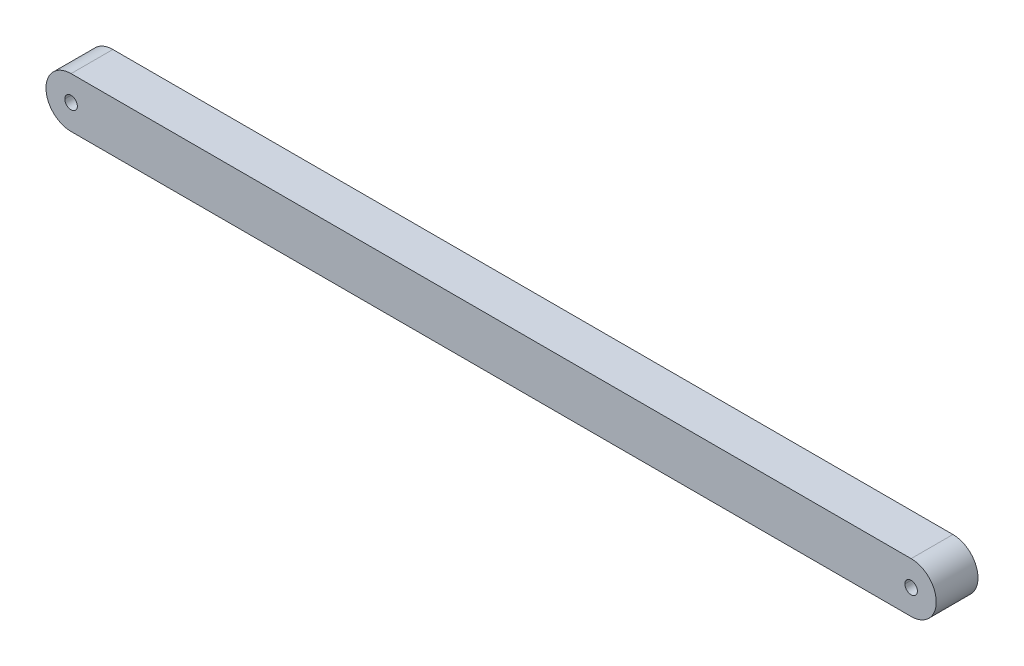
ISO-10303-21;
HEADER;
FILE_DESCRIPTION(('STEP AP214'),'2;1');
FILE_NAME('part.step','',(''),(''),'','','');
FILE_SCHEMA(('AUTOMOTIVE_DESIGN { 1 0 10303 214 1 1 1 1 }'));
ENDSEC;
DATA;
#1=APPLICATION_CONTEXT('core data for automotive mechanical design processes');
#2=APPLICATION_PROTOCOL_DEFINITION('international standard','automotive_design',2000,#1);
#3=PRODUCT_CONTEXT('',#1,'mechanical');
#4=PRODUCT('Part','Part','',(#3));
#5=PRODUCT_RELATED_PRODUCT_CATEGORY('part','',(#4));
#6=PRODUCT_DEFINITION_FORMATION('','',#4);
#7=PRODUCT_DEFINITION_CONTEXT('part definition',#1,'design');
#8=PRODUCT_DEFINITION('design','',#6,#7);
#9=PRODUCT_DEFINITION_SHAPE('','',#8);
#10=(LENGTH_UNIT() NAMED_UNIT(*) SI_UNIT(.MILLI.,.METRE.));
#11=(NAMED_UNIT(*) PLANE_ANGLE_UNIT() SI_UNIT($,.RADIAN.));
#12=(NAMED_UNIT(*) SI_UNIT($,.STERADIAN.) SOLID_ANGLE_UNIT());
#13=UNCERTAINTY_MEASURE_WITH_UNIT(LENGTH_MEASURE(1.E-05),#10,'distance_accuracy_value','');
#14=(GEOMETRIC_REPRESENTATION_CONTEXT(3) GLOBAL_UNCERTAINTY_ASSIGNED_CONTEXT((#13)) GLOBAL_UNIT_ASSIGNED_CONTEXT((#10,
#11,#12)) REPRESENTATION_CONTEXT('',''));
#15=CARTESIAN_POINT('',(0.,0.,0.));
#16=DIRECTION('',(0.,0.,1.));
#17=DIRECTION('',(1.,0.,0.));
#18=AXIS2_PLACEMENT_3D('',#15,#16,#17);
#19=CARTESIAN_POINT('',(-23.5495364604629,1.46409480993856,10.));
#20=DIRECTION('',(0.,0.,1.));
#21=DIRECTION('',(1.,0.,0.));
#22=AXIS2_PLACEMENT_3D('',#19,#20,#21);
#23=PLANE('',#22);
#24=CARTESIAN_POINT('',(183.779742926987,1.46411417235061,10.));
#25=CARTESIAN_POINT('',(183.881768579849,1.46415562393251,10.));
#26=CARTESIAN_POINT('',(183.98306451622,1.46677630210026,10.));
#27=CARTESIAN_POINT('',(184.258275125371,1.48079227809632,10.));
#28=CARTESIAN_POINT('',(184.391322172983,1.49405022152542,10.));
#29=CARTESIAN_POINT('',(184.76433292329,1.54044123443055,10.));
#30=CARTESIAN_POINT('',(184.956684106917,1.57766142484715,10.));
#31=CARTESIAN_POINT('',(185.471697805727,1.69763730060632,10.));
#32=CARTESIAN_POINT('',(185.747222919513,1.78885193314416,10.));
#33=CARTESIAN_POINT('',(186.359652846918,2.03382613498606,10.));
#34=CARTESIAN_POINT('',(186.679528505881,2.19947093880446,10.));
#35=CARTESIAN_POINT('',(187.42967806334,2.67234281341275,10.));
#36=CARTESIAN_POINT('',(187.831599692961,3.00893660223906,10.));
#37=CARTESIAN_POINT('',(189.58311425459,4.90156993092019,10.));
#38=CARTESIAN_POINT('',(190.109022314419,7.02572087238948,10.));
#39=CARTESIAN_POINT('',(189.347604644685,9.86745907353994,10.));
#40=CARTESIAN_POINT('',(188.935251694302,10.6570080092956,10.));
#41=CARTESIAN_POINT('',(187.998553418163,11.7685418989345,10.));
#42=CARTESIAN_POINT('',(187.564558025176,12.1580203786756,10.));
#43=CARTESIAN_POINT('',(186.749297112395,12.6911990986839,10.));
#44=CARTESIAN_POINT('',(186.411300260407,12.8716502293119,10.));
#45=CARTESIAN_POINT('',(185.803841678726,13.1178933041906,10.));
#46=CARTESIAN_POINT('',(185.563533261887,13.1993327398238,10.));
#47=CARTESIAN_POINT('',(185.13972120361,13.3102722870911,10.));
#48=CARTESIAN_POINT('',(184.974738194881,13.3466238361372,10.));
#49=CARTESIAN_POINT('',(184.687203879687,13.3960515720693,10.));
#50=CARTESIAN_POINT('',(184.575367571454,13.4122020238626,10.));
#51=CARTESIAN_POINT('',(184.339985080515,13.4389766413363,10.));
#52=CARTESIAN_POINT('',(184.217984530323,13.4499164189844,10.));
#53=CARTESIAN_POINT('',(183.97063689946,13.4617723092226,10.));
#54=CARTESIAN_POINT('',(183.875192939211,13.4640753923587,10.));
#55=CARTESIAN_POINT('',(183.779742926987,13.4641141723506,10.));
#56=B_SPLINE_CURVE_WITH_KNOTS('',3,(#24,#25,#26,#27,#28,#29,#30,#31,#32,#33,#34,#35,#36,#37,#38,
#39,#40,#41,#42,#43,#44,#45,#46,#47,#48,#49,#50,#51,#52,#53,#54,#55),.UNSPECIFIED.,.F.,.F.,(4,2,
2,2,2,2,2,2,2,2,2,2,2,2,2,4),(0.,0.00755193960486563,0.0205950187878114,0.04518956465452,
0.0890108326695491,0.148030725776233,0.237028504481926,0.591189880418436,0.742395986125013,
0.84087733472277,0.902499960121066,0.940047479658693,0.962855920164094,0.97693375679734,
0.991107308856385,1.),.UNSPECIFIED.);
#57=CARTESIAN_POINT('',(183.779742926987,1.46411417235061,10.));
#58=VERTEX_POINT('',#57);
#59=CARTESIAN_POINT('',(183.779742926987,13.4641141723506,10.));
#60=VERTEX_POINT('',#59);
#61=EDGE_CURVE('E11',#58,#60,#56,.T.);
#62=ORIENTED_EDGE('',*,*,#61,.T.);
#63=CARTESIAN_POINT('',(183.779742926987,13.4641141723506,10.));
#64=DIRECTION('',(-0.999999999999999,-5.14783049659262E-08,0.));
#65=VECTOR('',#64,1.);
#66=LINE('',#63,#65);
#67=CARTESIAN_POINT('',(-17.2202570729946,13.4641038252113,10.));
#68=VERTEX_POINT('',#67);
#69=EDGE_CURVE('E25',#60,#68,#66,.T.);
#70=ORIENTED_EDGE('',*,*,#69,.T.);
#71=CARTESIAN_POINT('',(-17.2202570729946,13.4641038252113,10.));
#72=CARTESIAN_POINT('',(-17.3222844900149,13.464103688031,10.));
#73=CARTESIAN_POINT('',(-17.4235795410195,13.461482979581,10.));
#74=CARTESIAN_POINT('',(-17.6987892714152,13.4474669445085,10.));
#75=CARTESIAN_POINT('',(-17.8318363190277,13.434208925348,10.));
#76=CARTESIAN_POINT('',(-18.2048470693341,13.387817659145,10.));
#77=CARTESIAN_POINT('',(-18.3971982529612,13.35059727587,10.));
#78=CARTESIAN_POINT('',(-18.912211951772,13.2306207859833,10.));
#79=CARTESIAN_POINT('',(-19.1877370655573,13.1394056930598,10.));
#80=CARTESIAN_POINT('',(-19.8001669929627,12.8944302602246,10.));
#81=CARTESIAN_POINT('',(-20.1200426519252,12.7287846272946,10.));
#82=CARTESIAN_POINT('',(-20.8701922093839,12.2559103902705,10.));
#83=CARTESIAN_POINT('',(-21.2721138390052,11.9193149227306,10.));
#84=CARTESIAN_POINT('',(-23.0236284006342,10.0266721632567,10.));
#85=CARTESIAN_POINT('',(-23.5495364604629,7.90251065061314,10.));
#86=CARTESIAN_POINT('',(-22.7881187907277,5.06075830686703,10.));
#87=CARTESIAN_POINT('',(-22.3757658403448,4.27120544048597,10.));
#88=CARTESIAN_POINT('',(-21.4390675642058,3.15966601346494,10.));
#89=CARTESIAN_POINT('',(-21.0050721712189,2.77018559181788,10.));
#90=CARTESIAN_POINT('',(-20.1898112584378,2.23700420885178,10.));
#91=CARTESIAN_POINT('',(-19.8518144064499,2.05655217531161,10.));
#92=CARTESIAN_POINT('',(-19.244355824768,1.81030786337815,10.));
#93=CARTESIAN_POINT('',(-19.00404740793,1.72886801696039,10.));
#94=CARTESIAN_POINT('',(-18.5802353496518,1.61792790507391,10.));
#95=CARTESIAN_POINT('',(-18.4152523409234,1.58157616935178,10.));
#96=CARTESIAN_POINT('',(-18.1277180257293,1.53214817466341,10.));
#97=CARTESIAN_POINT('',(-18.0158817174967,1.51599763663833,10.));
#98=CARTESIAN_POINT('',(-17.7804992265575,1.48922287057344,10.));
#99=CARTESIAN_POINT('',(-17.6584986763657,1.47828302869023,10.));
#100=CARTESIAN_POINT('',(-17.4111518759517,1.46642708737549,10.));
#101=CARTESIAN_POINT('',(-17.3157087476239,1.46412397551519,10.));
#102=CARTESIAN_POINT('',(-17.2202570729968,1.4641238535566,10.));
#103=B_SPLINE_CURVE_WITH_KNOTS('',3,(#71,#72,#73,#74,#75,#76,#77,#78,#79,#80,#81,#82,#83,#84,
#85,#86,#87,#88,#89,#90,#91,#92,#93,#94,#95,#96,#97,#98,#99,#100,#101,#102),.UNSPECIFIED.,.F.,
.F.,(4,2,2,2,2,2,2,2,2,2,2,2,2,2,2,4),(0.,0.0075518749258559,0.0205949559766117,
0.0451895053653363,0.0890107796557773,0.148030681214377,0.237028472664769,0.591189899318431,
0.742396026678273,0.840877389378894,0.90250002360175,0.940047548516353,0.96285599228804,
0.976933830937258,0.991107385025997,1.),.UNSPECIFIED.);
#104=CARTESIAN_POINT('',(-17.2202570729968,1.4641238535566,10.));
#105=VERTEX_POINT('',#104);
#106=EDGE_CURVE('E228',#68,#105,#103,.T.);
#107=ORIENTED_EDGE('',*,*,#106,.T.);
#108=CARTESIAN_POINT('',(-17.2202570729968,1.4641238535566,10.));
#109=DIRECTION('',(0.999999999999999,-4.81652039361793E-08,0.));
#110=VECTOR('',#109,1.);
#111=LINE('',#108,#110);
#112=EDGE_CURVE('E170',#105,#58,#111,.T.);
#113=ORIENTED_EDGE('',*,*,#112,.T.);
#114=EDGE_LOOP('',(#62,#70,#107,#113));
#115=FACE_BOUND('',#114,.T.);
#116=CARTESIAN_POINT('',(183.779742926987,7.46411417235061,10.));
#117=DIRECTION('',(0.,0.,1.));
#118=DIRECTION('',(-1.,0.,0.));
#119=AXIS2_PLACEMENT_3D('',#116,#117,#118);
#120=CIRCLE('',#119,1.5);
#121=CARTESIAN_POINT('',(182.279742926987,7.46411417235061,10.));
#122=VERTEX_POINT('',#121);
#123=CARTESIAN_POINT('',(185.279742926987,7.4641141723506,10.));
#124=VERTEX_POINT('',#123);
#125=EDGE_CURVE('E96',#122,#124,#120,.T.);
#126=ORIENTED_EDGE('',*,*,#125,.F.);
#127=CARTESIAN_POINT('',(183.779742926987,7.46411417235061,10.));
#128=DIRECTION('',(0.,0.,1.));
#129=DIRECTION('',(1.,0.,0.));
#130=AXIS2_PLACEMENT_3D('',#127,#128,#129);
#131=CIRCLE('',#130,1.5);
#132=EDGE_CURVE('E350',#124,#122,#131,.T.);
#133=ORIENTED_EDGE('',*,*,#132,.F.);
#134=EDGE_LOOP('',(#126,#133));
#135=FACE_BOUND('',#134,.T.);
#136=CARTESIAN_POINT('',(-17.2202570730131,7.46411417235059,10.));
#137=DIRECTION('',(0.,0.,1.));
#138=DIRECTION('',(-1.,0.,0.));
#139=AXIS2_PLACEMENT_3D('',#136,#137,#138);
#140=CIRCLE('',#139,1.5);
#141=CARTESIAN_POINT('',(-18.7202570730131,7.46411417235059,10.));
#142=VERTEX_POINT('',#141);
#143=CARTESIAN_POINT('',(-15.720257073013,7.46411417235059,10.));
#144=VERTEX_POINT('',#143);
#145=EDGE_CURVE('E340',#142,#144,#140,.T.);
#146=ORIENTED_EDGE('',*,*,#145,.F.);
#147=CARTESIAN_POINT('',(-17.2202570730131,7.46411417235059,10.));
#148=DIRECTION('',(0.,0.,1.));
#149=DIRECTION('',(1.,0.,0.));
#150=AXIS2_PLACEMENT_3D('',#147,#148,#149);
#151=CIRCLE('',#150,1.5);
#152=EDGE_CURVE('E343',#144,#142,#151,.T.);
#153=ORIENTED_EDGE('',*,*,#152,.F.);
#154=EDGE_LOOP('',(#146,#153));
#155=FACE_BOUND('',#154,.T.);
#156=ADVANCED_FACE('F17',(#115,#135,#155),#23,.T.);
#157=CARTESIAN_POINT('',(-17.2202570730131,7.46411417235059,10.));
#158=DIRECTION('',(0.,0.,-1.));
#159=DIRECTION('',(0.,-1.,0.));
#160=AXIS2_PLACEMENT_3D('',#157,#158,#159);
#161=CYLINDRICAL_SURFACE('',#160,1.5);
#162=ORIENTED_EDGE('',*,*,#152,.T.);
#163=CARTESIAN_POINT('',(-18.7202570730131,7.4641141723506,10.));
#164=DIRECTION('',(0.,0.,-1.));
#165=VECTOR('',#164,1.);
#166=LINE('',#163,#165);
#167=CARTESIAN_POINT('',(-18.7202570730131,7.46411417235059,0.));
#168=VERTEX_POINT('',#167);
#169=EDGE_CURVE('E354',#142,#168,#166,.T.);
#170=ORIENTED_EDGE('',*,*,#169,.T.);
#171=CARTESIAN_POINT('',(-15.720257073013,7.4641141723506,0.));
#172=CARTESIAN_POINT('',(-15.7203680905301,7.7373639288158,0.));
#173=CARTESIAN_POINT('',(-15.794706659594,8.00502312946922,0.));
#174=CARTESIAN_POINT('',(-16.0147094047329,8.36956636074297,0.));
#175=CARTESIAN_POINT('',(-16.1129760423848,8.48736806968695,0.));
#176=CARTESIAN_POINT('',(-16.3019844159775,8.65432883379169,0.));
#177=CARTESIAN_POINT('',(-16.3830890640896,8.71272632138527,0.));
#178=CARTESIAN_POINT('',(-16.5300813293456,8.79776078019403,0.));
#179=CARTESIAN_POINT('',(-16.5931752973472,8.82857841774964,0.));
#180=CARTESIAN_POINT('',(-16.7310650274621,8.88432397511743,0.));
#181=CARTESIAN_POINT('',(-16.8078215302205,8.91010531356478,0.));
#182=CARTESIAN_POINT('',(-16.9397356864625,8.93800261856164,0.));
#183=CARTESIAN_POINT('',(-16.9701335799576,8.94347907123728,0.));
#184=CARTESIAN_POINT('',(-17.0330603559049,8.9527534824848,0.));
#185=CARTESIAN_POINT('',(-17.065922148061,8.9566933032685,0.));
#186=CARTESIAN_POINT('',(-17.1286082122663,8.96149888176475,0.));
#187=CARTESIAN_POINT('',(-17.1524629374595,8.96281756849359,0.));
#188=CARTESIAN_POINT('',(-17.2010432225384,8.9641550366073,0.));
#189=CARTESIAN_POINT('',(-17.2232292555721,8.9642747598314,0.));
#190=CARTESIAN_POINT('',(-17.2819345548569,8.96329305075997,0.));
#191=CARTESIAN_POINT('',(-17.311992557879,8.96159697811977,0.));
#192=CARTESIAN_POINT('',(-17.4121727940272,8.95351516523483,0.));
#193=CARTESIAN_POINT('',(-17.4586862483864,8.94582381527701,0.));
#194=CARTESIAN_POINT('',(-17.5971943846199,8.91905877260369,0.));
#195=CARTESIAN_POINT('',(-17.6674898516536,8.89771046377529,0.));
#196=CARTESIAN_POINT('',(-17.8535556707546,8.82979666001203,0.));
#197=CARTESIAN_POINT('',(-17.9512560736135,8.77828893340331,0.));
#198=CARTESIAN_POINT('',(-18.1850076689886,8.62552157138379,0.));
#199=CARTESIAN_POINT('',(-18.3044006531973,8.51296978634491,0.));
#200=CARTESIAN_POINT('',(-18.6087096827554,8.1230520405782,0.));
#201=CARTESIAN_POINT('',(-18.7201211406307,7.79868741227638,0.));
#202=CARTESIAN_POINT('',(-18.720257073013,7.46411417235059,0.));
#203=B_SPLINE_CURVE_WITH_KNOTS('',3,(#171,#172,#173,#174,#175,#176,#177,#178,#179,#180,#181,
#182,#183,#184,#185,#186,#187,#188,#189,#190,#191,#192,#193,#194,#195,#196,#197,#198,#199,#200,
#201,#202),.UNSPECIFIED.,.F.,.F.,(4,2,2,2,2,2,2,2,2,2,2,2,2,2,2,4),(0.,0.144163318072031,
0.224609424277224,0.277196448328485,0.314194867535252,0.355660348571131,0.36785753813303,
0.380267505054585,0.387564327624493,0.393689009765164,0.403779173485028,0.428436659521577,
0.477485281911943,0.56469175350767,0.705509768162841,1.),.UNSPECIFIED.);
#204=CARTESIAN_POINT('',(-15.7202570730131,7.46411417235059,0.));
#205=VERTEX_POINT('',#204);
#206=EDGE_CURVE('E366',#205,#168,#203,.T.);
#207=ORIENTED_EDGE('',*,*,#206,.F.);
#208=CARTESIAN_POINT('',(-15.7202570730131,7.46411417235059,0.));
#209=DIRECTION('',(0.,0.,1.));
#210=VECTOR('',#209,1.);
#211=LINE('',#208,#210);
#212=EDGE_CURVE('E357',#205,#144,#211,.T.);
#213=ORIENTED_EDGE('',*,*,#212,.T.);
#214=EDGE_LOOP('',(#162,#170,#207,#213));
#215=FACE_BOUND('',#214,.T.);
#216=ADVANCED_FACE('F330',(#215),#161,.F.);
#217=CARTESIAN_POINT('',(-17.2202570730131,7.46411417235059,10.));
#218=DIRECTION('',(0.,0.,-1.));
#219=DIRECTION('',(0.,1.,0.));
#220=AXIS2_PLACEMENT_3D('',#217,#218,#219);
#221=CYLINDRICAL_SURFACE('',#220,1.5);
#222=CARTESIAN_POINT('',(-18.720257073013,7.46411417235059,0.));
#223=CARTESIAN_POINT('',(-18.720146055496,7.1908644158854,0.));
#224=CARTESIAN_POINT('',(-18.6458074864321,6.92320521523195,0.));
#225=CARTESIAN_POINT('',(-18.4258047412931,6.55866198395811,0.));
#226=CARTESIAN_POINT('',(-18.3275381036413,6.44086027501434,0.));
#227=CARTESIAN_POINT('',(-18.1385297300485,6.27389951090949,0.));
#228=CARTESIAN_POINT('',(-18.0574250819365,6.21550202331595,0.));
#229=CARTESIAN_POINT('',(-17.9104328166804,6.13046756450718,0.));
#230=CARTESIAN_POINT('',(-17.8473388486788,6.09964992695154,0.));
#231=CARTESIAN_POINT('',(-17.709449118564,6.04390436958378,0.));
#232=CARTESIAN_POINT('',(-17.6326926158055,6.0181230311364,0.));
#233=CARTESIAN_POINT('',(-17.5007784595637,5.99022572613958,0.));
#234=CARTESIAN_POINT('',(-17.4703805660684,5.98474927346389,0.));
#235=CARTESIAN_POINT('',(-17.4074537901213,5.9754748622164,0.));
#236=CARTESIAN_POINT('',(-17.374591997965,5.97153504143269,0.));
#237=CARTESIAN_POINT('',(-17.3119059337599,5.96672946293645,0.));
#238=CARTESIAN_POINT('',(-17.2880512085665,5.9654107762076,0.));
#239=CARTESIAN_POINT('',(-17.2394709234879,5.9640733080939,0.));
#240=CARTESIAN_POINT('',(-17.2172848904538,5.96395358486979,0.));
#241=CARTESIAN_POINT('',(-17.1585795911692,5.96493529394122,0.));
#242=CARTESIAN_POINT('',(-17.128521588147,5.96663136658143,0.));
#243=CARTESIAN_POINT('',(-17.028341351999,5.97471317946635,0.));
#244=CARTESIAN_POINT('',(-16.9818278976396,5.98240452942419,0.));
#245=CARTESIAN_POINT('',(-16.8433197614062,6.0091695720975,0.));
#246=CARTESIAN_POINT('',(-16.7730242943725,6.03051788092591,0.));
#247=CARTESIAN_POINT('',(-16.5869584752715,6.09843168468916,0.));
#248=CARTESIAN_POINT('',(-16.4892580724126,6.14993941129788,0.));
#249=CARTESIAN_POINT('',(-16.2555064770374,6.3027067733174,0.));
#250=CARTESIAN_POINT('',(-16.1361134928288,6.41525855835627,0.));
#251=CARTESIAN_POINT('',(-15.8318044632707,6.80517630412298,0.));
#252=CARTESIAN_POINT('',(-15.7203930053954,7.12954093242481,0.));
#253=CARTESIAN_POINT('',(-15.720257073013,7.4641141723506,0.));
#254=B_SPLINE_CURVE_WITH_KNOTS('',3,(#222,#223,#224,#225,#226,#227,#228,#229,#230,#231,#232,
#233,#234,#235,#236,#237,#238,#239,#240,#241,#242,#243,#244,#245,#246,#247,#248,#249,#250,#251,
#252,#253),.UNSPECIFIED.,.F.,.F.,(4,2,2,2,2,2,2,2,2,2,2,2,2,2,2,4),(0.,0.144163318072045,
0.224609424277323,0.277196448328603,0.314194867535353,0.355660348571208,0.367857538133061,
0.380267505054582,0.387564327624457,0.393689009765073,0.403779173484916,0.428436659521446,
0.477485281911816,0.564691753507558,0.705509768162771,1.),.UNSPECIFIED.);
#255=EDGE_CURVE('E363',#168,#205,#254,.T.);
#256=ORIENTED_EDGE('',*,*,#255,.F.);
#257=ORIENTED_EDGE('',*,*,#169,.F.);
#258=ORIENTED_EDGE('',*,*,#145,.T.);
#259=ORIENTED_EDGE('',*,*,#212,.F.);
#260=EDGE_LOOP('',(#256,#257,#258,#259));
#261=FACE_BOUND('',#260,.T.);
#262=ADVANCED_FACE('F334',(#261),#221,.F.);
#263=CARTESIAN_POINT('',(-23.5495364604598,1.46409347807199,0.));
#264=DIRECTION('',(0.,0.,-1.));
#265=DIRECTION('',(0.,1.,0.));
#266=AXIS2_PLACEMENT_3D('',#263,#264,#265);
#267=PLANE('',#266);
#268=CARTESIAN_POINT('',(-17.2202570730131,7.46411417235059,0.));
#269=DIRECTION('',(0.,0.,1.));
#270=DIRECTION('',(3.83489536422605E-12,1.,0.));
#271=AXIS2_PLACEMENT_3D('',#268,#269,#270);
#272=CIRCLE('',#271,6.00000000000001);
#273=CARTESIAN_POINT('',(-17.2202570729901,13.4641044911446,0.));
#274=VERTEX_POINT('',#273);
#275=CARTESIAN_POINT('',(-17.2202570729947,1.46412451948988,0.));
#276=VERTEX_POINT('',#275);
#277=EDGE_CURVE('E194',#274,#276,#272,.T.);
#278=ORIENTED_EDGE('',*,*,#277,.F.);
#279=CARTESIAN_POINT('',(183.779742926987,13.4641141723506,0.));
#280=DIRECTION('',(-1.,0.,0.));
#281=VECTOR('',#280,1.);
#282=LINE('',#279,#281);
#283=CARTESIAN_POINT('',(183.779742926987,13.4641141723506,0.));
#284=VERTEX_POINT('',#283);
#285=EDGE_CURVE('E245',#284,#274,#282,.T.);
#286=ORIENTED_EDGE('',*,*,#285,.F.);
#287=CARTESIAN_POINT('',(183.779742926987,7.46411417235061,0.));
#288=DIRECTION('',(0.,0.,1.));
#289=DIRECTION('',(0.,-1.,0.));
#290=AXIS2_PLACEMENT_3D('',#287,#288,#289);
#291=CIRCLE('',#290,6.);
#292=CARTESIAN_POINT('',(183.779742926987,1.46411417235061,0.));
#293=VERTEX_POINT('',#292);
#294=EDGE_CURVE('E284',#293,#284,#291,.T.);
#295=ORIENTED_EDGE('',*,*,#294,.F.);
#296=CARTESIAN_POINT('',(-17.220257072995,1.46411417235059,0.));
#297=DIRECTION('',(1.,0.,0.));
#298=VECTOR('',#297,1.);
#299=LINE('',#296,#298);
#300=EDGE_CURVE('E107',#276,#293,#299,.T.);
#301=ORIENTED_EDGE('',*,*,#300,.F.);
#302=EDGE_LOOP('',(#278,#286,#295,#301));
#303=FACE_BOUND('',#302,.T.);
#304=ORIENTED_EDGE('',*,*,#206,.T.);
#305=ORIENTED_EDGE('',*,*,#255,.T.);
#306=EDGE_LOOP('',(#304,#305));
#307=FACE_BOUND('',#306,.T.);
#308=CARTESIAN_POINT('',(185.279742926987,7.46411417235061,0.));
#309=CARTESIAN_POINT('',(185.27963190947,7.73736392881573,0.));
#310=CARTESIAN_POINT('',(185.205293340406,8.00502312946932,0.));
#311=CARTESIAN_POINT('',(184.985290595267,8.36956636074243,0.));
#312=CARTESIAN_POINT('',(184.887023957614,8.48736806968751,0.));
#313=CARTESIAN_POINT('',(184.698015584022,8.65432883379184,0.));
#314=CARTESIAN_POINT('',(184.61691093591,8.71272632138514,0.));
#315=CARTESIAN_POINT('',(184.469918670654,8.79776078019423,0.));
#316=CARTESIAN_POINT('',(184.406824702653,8.82857841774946,0.));
#317=CARTESIAN_POINT('',(184.268934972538,8.88432397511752,0.));
#318=CARTESIAN_POINT('',(184.19217846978,8.91010531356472,0.));
#319=CARTESIAN_POINT('',(184.060264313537,8.93800261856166,0.));
#320=CARTESIAN_POINT('',(184.029866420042,8.94347907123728,0.));
#321=CARTESIAN_POINT('',(183.966939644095,8.95275348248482,0.));
#322=CARTESIAN_POINT('',(183.934077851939,8.9566933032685,0.));
#323=CARTESIAN_POINT('',(183.871391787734,8.96149888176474,0.));
#324=CARTESIAN_POINT('',(183.84753706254,8.9628175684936,0.));
#325=CARTESIAN_POINT('',(183.798956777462,8.96415503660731,0.));
#326=CARTESIAN_POINT('',(183.776770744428,8.96427475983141,0.));
#327=CARTESIAN_POINT('',(183.718065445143,8.96329305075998,0.));
#328=CARTESIAN_POINT('',(183.688007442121,8.96159697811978,0.));
#329=CARTESIAN_POINT('',(183.587827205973,8.95351516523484,0.));
#330=CARTESIAN_POINT('',(183.541313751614,8.94582381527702,0.));
#331=CARTESIAN_POINT('',(183.40280561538,8.91905877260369,0.));
#332=CARTESIAN_POINT('',(183.332510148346,8.89771046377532,0.));
#333=CARTESIAN_POINT('',(183.146444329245,8.829796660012,0.));
#334=CARTESIAN_POINT('',(183.048743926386,8.77828893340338,0.));
#335=CARTESIAN_POINT('',(182.814992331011,8.62552157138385,0.));
#336=CARTESIAN_POINT('',(182.695599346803,8.51296978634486,0.));
#337=CARTESIAN_POINT('',(182.391290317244,8.12305204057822,0.));
#338=CARTESIAN_POINT('',(182.279878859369,7.79868741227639,0.));
#339=CARTESIAN_POINT('',(182.279742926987,7.46411417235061,0.));
#340=B_SPLINE_CURVE_WITH_KNOTS('',3,(#308,#309,#310,#311,#312,#313,#314,#315,#316,#317,#318,
#319,#320,#321,#322,#323,#324,#325,#326,#327,#328,#329,#330,#331,#332,#333,#334,#335,#336,#337,
#338,#339),.UNSPECIFIED.,.F.,.F.,(4,2,2,2,2,2,2,2,2,2,2,2,2,2,2,4),(0.,0.144163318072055,
0.224609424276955,0.277196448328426,0.314194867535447,0.35566034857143,0.367857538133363,
0.380267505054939,0.387564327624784,0.393689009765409,0.403779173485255,0.42843665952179,
0.477485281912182,0.564691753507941,0.70550976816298,1.),.UNSPECIFIED.);
#341=CARTESIAN_POINT('',(185.279742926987,7.4641141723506,0.));
#342=VERTEX_POINT('',#341);
#343=CARTESIAN_POINT('',(182.279742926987,7.46411417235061,0.));
#344=VERTEX_POINT('',#343);
#345=EDGE_CURVE('E82',#342,#344,#340,.T.);
#346=ORIENTED_EDGE('',*,*,#345,.T.);
#347=CARTESIAN_POINT('',(182.279742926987,7.46411417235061,0.));
#348=CARTESIAN_POINT('',(182.279853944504,7.19086441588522,0.));
#349=CARTESIAN_POINT('',(182.354192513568,6.92320521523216,0.));
#350=CARTESIAN_POINT('',(182.574195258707,6.55866198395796,0.));
#351=CARTESIAN_POINT('',(182.672461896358,6.44086027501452,0.));
#352=CARTESIAN_POINT('',(182.861470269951,6.27389951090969,0.));
#353=CARTESIAN_POINT('',(182.942574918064,6.21550202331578,0.));
#354=CARTESIAN_POINT('',(183.089567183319,6.13046756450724,0.));
#355=CARTESIAN_POINT('',(183.152661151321,6.09964992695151,0.));
#356=CARTESIAN_POINT('',(183.290550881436,6.0439043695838,0.));
#357=CARTESIAN_POINT('',(183.367307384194,6.01812303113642,0.));
#358=CARTESIAN_POINT('',(183.499221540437,5.99022572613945,0.));
#359=CARTESIAN_POINT('',(183.529619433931,5.98474927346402,0.));
#360=CARTESIAN_POINT('',(183.592546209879,5.97547486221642,0.));
#361=CARTESIAN_POINT('',(183.625408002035,5.9715350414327,0.));
#362=CARTESIAN_POINT('',(183.68809406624,5.96672946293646,0.));
#363=CARTESIAN_POINT('',(183.711948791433,5.96541077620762,0.));
#364=CARTESIAN_POINT('',(183.760529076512,5.96407330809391,0.));
#365=CARTESIAN_POINT('',(183.782715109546,5.96395358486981,0.));
#366=CARTESIAN_POINT('',(183.841420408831,5.96493529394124,0.));
#367=CARTESIAN_POINT('',(183.871478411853,5.96663136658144,0.));
#368=CARTESIAN_POINT('',(183.971658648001,5.97471317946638,0.));
#369=CARTESIAN_POINT('',(184.01817210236,5.98240452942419,0.));
#370=CARTESIAN_POINT('',(184.156680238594,6.0091695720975,0.));
#371=CARTESIAN_POINT('',(184.226975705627,6.03051788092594,0.));
#372=CARTESIAN_POINT('',(184.413041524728,6.09843168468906,0.));
#373=CARTESIAN_POINT('',(184.510741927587,6.14993941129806,0.));
#374=CARTESIAN_POINT('',(184.744493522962,6.30270677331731,0.));
#375=CARTESIAN_POINT('',(184.863886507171,6.41525855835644,0.));
#376=CARTESIAN_POINT('',(185.168195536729,6.80517630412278,0.));
#377=CARTESIAN_POINT('',(185.279606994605,7.12954093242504,0.));
#378=CARTESIAN_POINT('',(185.279742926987,7.46411417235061,0.));
#379=B_SPLINE_CURVE_WITH_KNOTS('',3,(#347,#348,#349,#350,#351,#352,#353,#354,#355,#356,#357,
#358,#359,#360,#361,#362,#363,#364,#365,#366,#367,#368,#369,#370,#371,#372,#373,#374,#375,#376,
#377,#378),.UNSPECIFIED.,.F.,.F.,(4,2,2,2,2,2,2,2,2,2,2,2,2,2,2,4),(0.,0.1441633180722,
0.224609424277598,0.277196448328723,0.314194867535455,0.355660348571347,0.367857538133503,
0.380267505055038,0.387564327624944,0.393689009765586,0.403779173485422,0.428436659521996,
0.477485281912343,0.564691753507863,0.70550976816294,1.),.UNSPECIFIED.);
#380=EDGE_CURVE('E77',#344,#342,#379,.T.);
#381=ORIENTED_EDGE('',*,*,#380,.T.);
#382=EDGE_LOOP('',(#346,#381));
#383=FACE_BOUND('',#382,.T.);
#384=ADVANCED_FACE('F80',(#303,#307,#383),#267,.T.);
#385=CARTESIAN_POINT('',(183.779742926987,7.46411417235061,10.));
#386=DIRECTION('',(0.,0.,-1.));
#387=DIRECTION('',(0.,1.,0.));
#388=AXIS2_PLACEMENT_3D('',#385,#386,#387);
#389=CYLINDRICAL_SURFACE('',#388,1.5);
#390=ORIENTED_EDGE('',*,*,#380,.F.);
#391=CARTESIAN_POINT('',(182.279742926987,7.46411417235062,10.));
#392=DIRECTION('',(0.,0.,-1.));
#393=VECTOR('',#392,1.);
#394=LINE('',#391,#393);
#395=EDGE_CURVE('E88',#122,#344,#394,.T.);
#396=ORIENTED_EDGE('',*,*,#395,.F.);
#397=ORIENTED_EDGE('',*,*,#125,.T.);
#398=CARTESIAN_POINT('',(185.279742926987,7.46411417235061,0.));
#399=DIRECTION('',(0.,0.,1.));
#400=VECTOR('',#399,1.);
#401=LINE('',#398,#400);
#402=EDGE_CURVE('E93',#342,#124,#401,.T.);
#403=ORIENTED_EDGE('',*,*,#402,.F.);
#404=EDGE_LOOP('',(#390,#396,#397,#403));
#405=FACE_BOUND('',#404,.T.);
#406=ADVANCED_FACE('F95',(#405),#389,.F.);
#407=CARTESIAN_POINT('',(183.779742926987,7.46411417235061,10.));
#408=DIRECTION('',(0.,0.,-1.));
#409=DIRECTION('',(0.,-1.,0.));
#410=AXIS2_PLACEMENT_3D('',#407,#408,#409);
#411=CYLINDRICAL_SURFACE('',#410,1.5);
#412=ORIENTED_EDGE('',*,*,#132,.T.);
#413=ORIENTED_EDGE('',*,*,#395,.T.);
#414=ORIENTED_EDGE('',*,*,#345,.F.);
#415=ORIENTED_EDGE('',*,*,#402,.T.);
#416=EDGE_LOOP('',(#412,#413,#414,#415));
#417=FACE_BOUND('',#416,.T.);
#418=ADVANCED_FACE('F105',(#417),#411,.F.);
#419=CARTESIAN_POINT('',(183.779742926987,1.46411417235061,0.));
#420=DIRECTION('',(0.,-1.,0.));
#421=DIRECTION('',(0.,0.,1.));
#422=AXIS2_PLACEMENT_3D('',#419,#420,#421);
#423=PLANE('',#422);
#424=ORIENTED_EDGE('',*,*,#300,.T.);
#425=CARTESIAN_POINT('',(183.779742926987,1.46411417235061,10.));
#426=DIRECTION('',(0.,0.,-1.));
#427=VECTOR('',#426,1.);
#428=LINE('',#425,#427);
#429=EDGE_CURVE('E101',#58,#293,#428,.T.);
#430=ORIENTED_EDGE('',*,*,#429,.F.);
#431=ORIENTED_EDGE('',*,*,#112,.F.);
#432=CARTESIAN_POINT('',(-17.220257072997,1.46411417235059,10.));
#433=DIRECTION('',(1.99840144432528E-13,0.,-1.));
#434=VECTOR('',#433,1.);
#435=LINE('',#432,#434);
#436=EDGE_CURVE('E181',#105,#276,#435,.T.);
#437=ORIENTED_EDGE('',*,*,#436,.T.);
#438=EDGE_LOOP('',(#424,#430,#431,#437));
#439=FACE_BOUND('',#438,.T.);
#440=ADVANCED_FACE('F125',(#439),#423,.T.);
#441=CARTESIAN_POINT('',(-17.2202570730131,7.46411417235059,10.));
#442=DIRECTION('',(0.,0.,-1.));
#443=DIRECTION('',(1.,-3.84481675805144E-13,0.));
#444=AXIS2_PLACEMENT_3D('',#441,#442,#443);
#445=CYLINDRICAL_SURFACE('',#444,6.00000000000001);
#446=ORIENTED_EDGE('',*,*,#277,.T.);
#447=ORIENTED_EDGE('',*,*,#436,.F.);
#448=ORIENTED_EDGE('',*,*,#106,.F.);
#449=CARTESIAN_POINT('',(-17.2202570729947,13.4641141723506,10.));
#450=DIRECTION('',(4.62130334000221E-13,0.,-1.));
#451=VECTOR('',#450,1.);
#452=LINE('',#449,#451);
#453=EDGE_CURVE('E237',#68,#274,#452,.T.);
#454=ORIENTED_EDGE('',*,*,#453,.T.);
#455=EDGE_LOOP('',(#446,#447,#448,#454));
#456=FACE_BOUND('',#455,.T.);
#457=ADVANCED_FACE('F199',(#456),#445,.T.);
#458=CARTESIAN_POINT('',(-17.2202570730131,13.4641141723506,10.));
#459=DIRECTION('',(0.,1.,0.));
#460=DIRECTION('',(1.,0.,0.));
#461=AXIS2_PLACEMENT_3D('',#458,#459,#460);
#462=PLANE('',#461);
#463=ORIENTED_EDGE('',*,*,#285,.T.);
#464=ORIENTED_EDGE('',*,*,#453,.F.);
#465=ORIENTED_EDGE('',*,*,#69,.F.);
#466=CARTESIAN_POINT('',(183.779742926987,13.4641141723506,10.));
#467=DIRECTION('',(0.,0.,-1.));
#468=VECTOR('',#467,1.);
#469=LINE('',#466,#468);
#470=EDGE_CURVE('E246',#60,#284,#469,.T.);
#471=ORIENTED_EDGE('',*,*,#470,.T.);
#472=EDGE_LOOP('',(#463,#464,#465,#471));
#473=FACE_BOUND('',#472,.T.);
#474=ADVANCED_FACE('F208',(#473),#462,.T.);
#475=CARTESIAN_POINT('',(183.779742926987,7.46411417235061,10.));
#476=DIRECTION('',(0.,0.,-1.));
#477=DIRECTION('',(-1.,0.,0.));
#478=AXIS2_PLACEMENT_3D('',#475,#476,#477);
#479=CYLINDRICAL_SURFACE('',#478,6.);
#480=ORIENTED_EDGE('',*,*,#294,.T.);
#481=ORIENTED_EDGE('',*,*,#470,.F.);
#482=ORIENTED_EDGE('',*,*,#61,.F.);
#483=ORIENTED_EDGE('',*,*,#429,.T.);
#484=EDGE_LOOP('',(#480,#481,#482,#483));
#485=FACE_BOUND('',#484,.T.);
#486=ADVANCED_FACE('F289',(#485),#479,.T.);
#487=CLOSED_SHELL('',(#156,#216,#262,#384,#406,#418,#440,#457,#474,#486));
#488=MANIFOLD_SOLID_BREP('B1',#487);
#489=ADVANCED_BREP_SHAPE_REPRESENTATION('',(#18,#488),#14);
#490=SHAPE_DEFINITION_REPRESENTATION(#9,#489);
ENDSEC;
END-ISO-10303-21;
